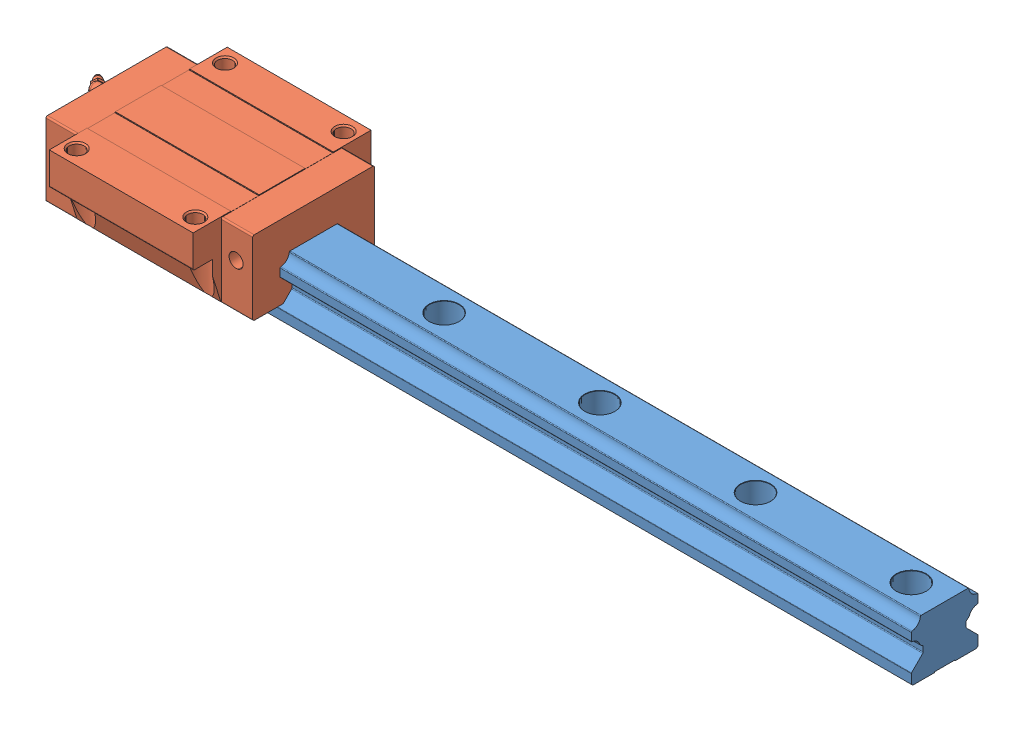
SolidWorks assembly HLW45CC.stp.sldasm, configuration 默认 (file format 13000). Lengths in mm.
Overall size (579.43 60 120).
2 component instances, 2 part files, 0 mates.
Components (placement in the parent):
- HLR45R570 E=22.5-1: HLR45R570 E=22.5.SLDPRT [默认] at origin size (570 38 45)
- HLW45CC-1: HLW45CC.SLDPRT [默认] at (5 9.5 0) size (153.83 50.5 120)
